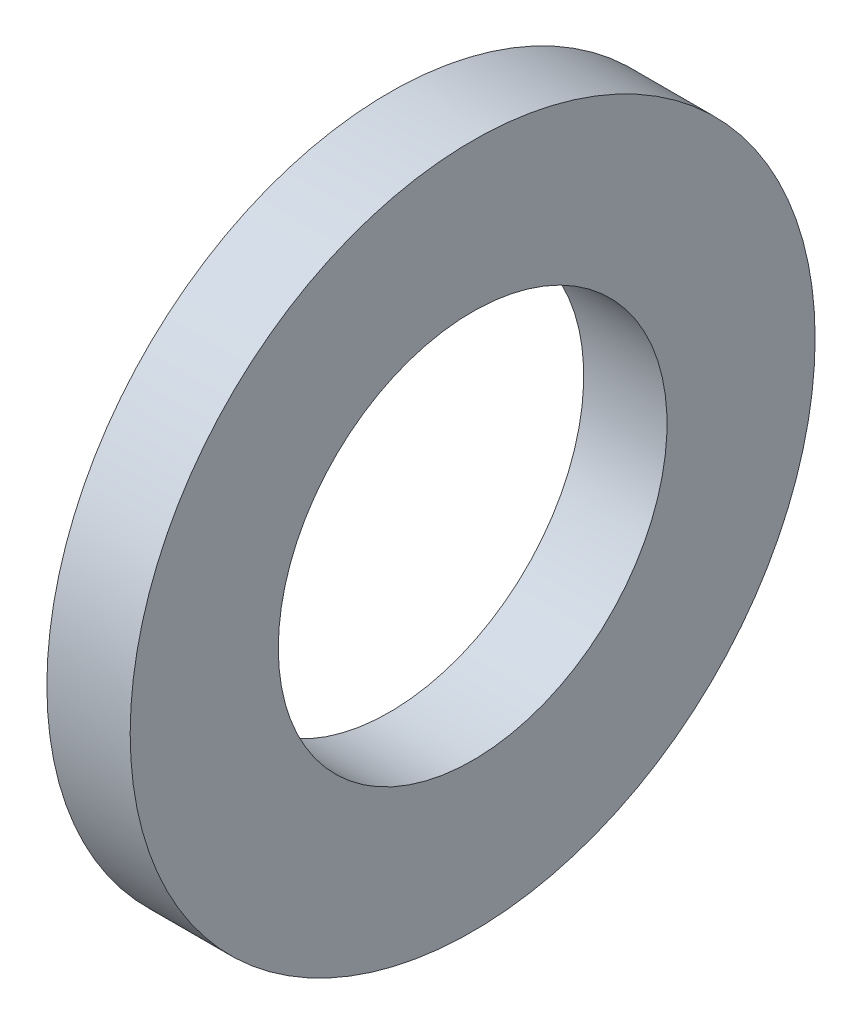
from build123d import *

# Parameters (mm, degrees)
SKETCH1_W = 4.5
SKETCH1_H = 8


with BuildPart() as part:
    # Sketch1 → Base-Revolve (revolve)
    with BuildSketch(Plane.XY, mode=Mode.PRIVATE) as base_revolve_sk:
        with Locations((-2.25, 14.5)):
            Rectangle(SKETCH1_W, SKETCH1_H)
    revolve(base_revolve_sk.sketch.rotate(Axis((-34.925, 0, 0), (1, 0, 0)), 90), axis=Axis((-34.925, 0, 0), (1, 0, 0)))


solid = part.part
